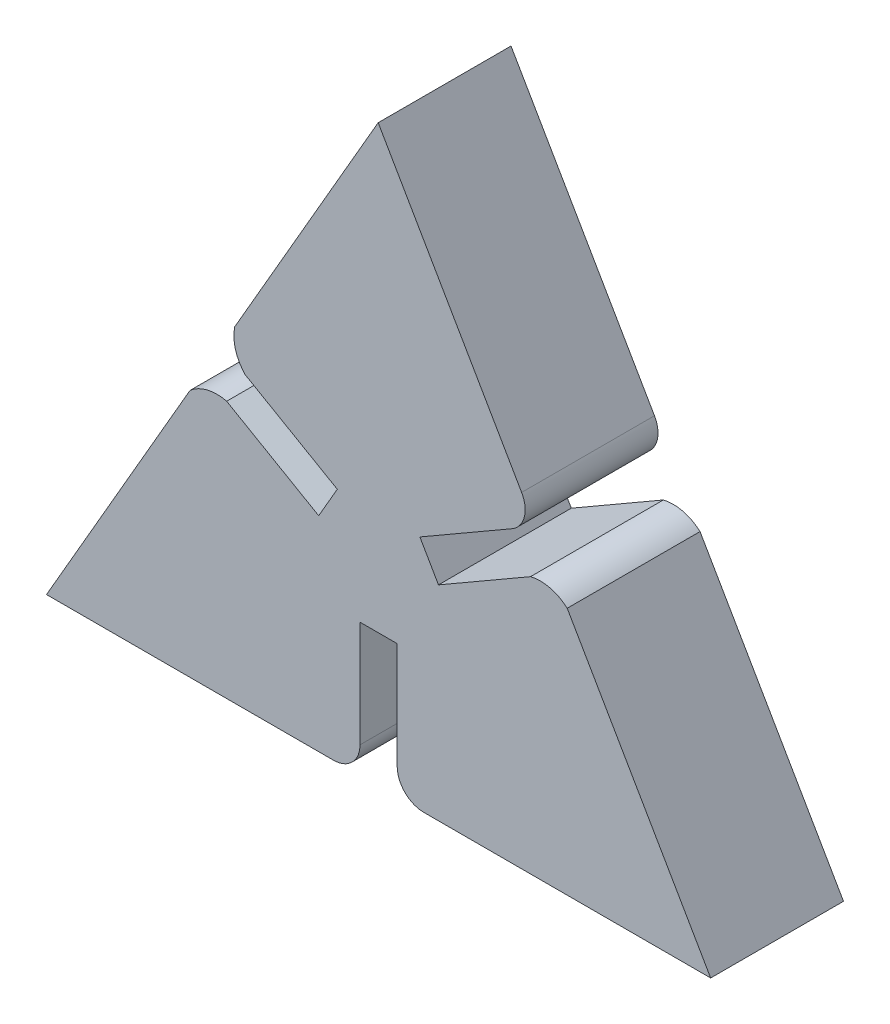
from build123d import *

# Parameters (mm, degrees)
BOSS_EXTRUDE3_DEPTH = 10


with BuildPart() as part:
    # Sketch1 → Boss-Extrude3 (new body)
    with BuildSketch(Plane.XY):
        with BuildLine():
            Line((-14.2, -8.159407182), (-25, -26.865555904))
            Line((-25, -26.865555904), (-3.4, -26.865555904))
            ThreePointArc((-3.4, -26.865555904), (-1.985786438, -26.279769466), (-1.4, -24.865555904))
            Line((-1.4, -24.865555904), (-1.4, -16.865555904))
            Line((-1.4, -16.865555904), (1.4, -16.865555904))
            Line((1.4, -16.865555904), (1.4, -24.865555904))
            ThreePointArc((1.4, -24.865555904), (1.985786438, -26.279769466), (3.4, -26.865555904))
            Line((3.4, -26.865555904), (25, -26.865555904))
            Line((25, -26.865555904), (14.2, -8.159407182))
            ThreePointArc((14.2, -8.159407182), (12.902721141, -7.477892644), (11.437324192, -7.48040043))
            Line((11.437324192, -7.48040043), (4.509120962, -11.48040043))
            Line((4.509120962, -11.48040043), (3.109120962, -9.0555293))
            Line((3.109120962, -9.0555293), (10.037324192, -5.0555293))
            ThreePointArc((10.037324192, -5.0555293), (10.969175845, -3.841116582), (10.769375, -2.323478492))
            Line((10.769375, -2.323478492), (-0.030625, 16.38267023))
            Line((-0.030625, 16.38267023), (-10.830625, -2.323478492))
            ThreePointArc((-10.830625, -2.323478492), (-10.772194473, -3.787712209), (-10.037324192, -5.0555293))
            Line((-10.037324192, -5.0555293), (-3.109120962, -9.0555293))
            Line((-3.109120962, -9.0555293), (-4.509120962, -11.48040043))
            Line((-4.509120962, -11.48040043), (-11.437324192, -7.48040043))
            ThreePointArc((-11.437324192, -7.48040043), (-12.902721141, -7.477892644), (-14.2, -8.159407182))
        make_face()
    extrude(amount=BOSS_EXTRUDE3_DEPTH)


solid = part.part
